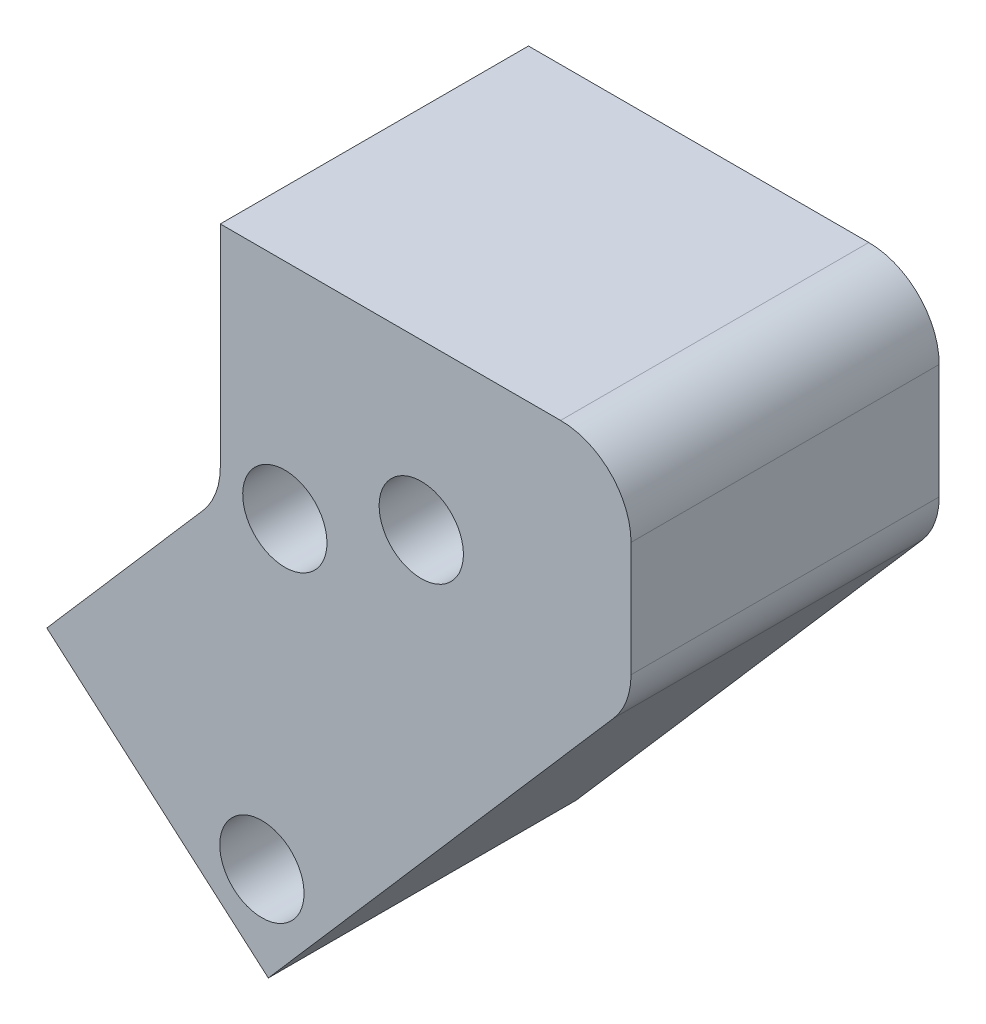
ISO-10303-21;
HEADER;
FILE_DESCRIPTION(('STEP AP214'),'2;1');
FILE_NAME('part.step','',(''),(''),'','','');
FILE_SCHEMA(('AUTOMOTIVE_DESIGN { 1 0 10303 214 1 1 1 1 }'));
ENDSEC;
DATA;
#1=APPLICATION_CONTEXT('core data for automotive mechanical design processes');
#2=APPLICATION_PROTOCOL_DEFINITION('international standard','automotive_design',2000,#1);
#3=PRODUCT_CONTEXT('',#1,'mechanical');
#4=PRODUCT('Part','Part','',(#3));
#5=PRODUCT_RELATED_PRODUCT_CATEGORY('part','',(#4));
#6=PRODUCT_DEFINITION_FORMATION('','',#4);
#7=PRODUCT_DEFINITION_CONTEXT('part definition',#1,'design');
#8=PRODUCT_DEFINITION('design','',#6,#7);
#9=PRODUCT_DEFINITION_SHAPE('','',#8);
#10=(LENGTH_UNIT() NAMED_UNIT(*) SI_UNIT(.MILLI.,.METRE.));
#11=(NAMED_UNIT(*) PLANE_ANGLE_UNIT() SI_UNIT($,.RADIAN.));
#12=(NAMED_UNIT(*) SI_UNIT($,.STERADIAN.) SOLID_ANGLE_UNIT());
#13=UNCERTAINTY_MEASURE_WITH_UNIT(LENGTH_MEASURE(1.E-05),#10,'distance_accuracy_value','');
#14=(GEOMETRIC_REPRESENTATION_CONTEXT(3) GLOBAL_UNCERTAINTY_ASSIGNED_CONTEXT((#13)) GLOBAL_UNIT_ASSIGNED_CONTEXT((#10,
#11,#12)) REPRESENTATION_CONTEXT('',''));
#15=CARTESIAN_POINT('',(0.,0.,0.));
#16=DIRECTION('',(0.,0.,1.));
#17=DIRECTION('',(1.,0.,0.));
#18=AXIS2_PLACEMENT_3D('',#15,#16,#17);
#19=CARTESIAN_POINT('',(-682.349668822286,-60.4557863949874,26.0096));
#20=DIRECTION('',(0.75503010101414,-0.655690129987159,0.));
#21=DIRECTION('',(0.655690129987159,0.75503010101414,0.));
#22=AXIS2_PLACEMENT_3D('',#19,#20,#21);
#23=PLANE('',#22);
#24=DIRECTION('',(0.,0.,-1.));
#25=VECTOR('',#24,1.);
#26=CARTESIAN_POINT('',(-682.349668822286,-60.4557863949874,26.0096));
#27=LINE('',#26,#25);
#28=CARTESIAN_POINT('',(-682.349668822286,-60.4557863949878,1.59986188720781));
#29=VERTEX_POINT('',#28);
#30=CARTESIAN_POINT('',(-682.349668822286,-60.4557863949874,-31.75));
#31=VERTEX_POINT('',#30);
#32=EDGE_CURVE('E55',#29,#31,#27,.T.);
#33=ORIENTED_EDGE('',*,*,#32,.F.);
#34=DIRECTION('',(0.655690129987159,0.75503010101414,3.73824128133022E-12));
#35=VECTOR('',#34,1.);
#36=CARTESIAN_POINT('',(-682.349668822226,-60.4557863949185,1.59986188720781));
#37=LINE('',#36,#35);
#38=CARTESIAN_POINT('',(-665.441670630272,-40.9861512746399,1.59986188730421));
#39=VERTEX_POINT('',#38);
#40=EDGE_CURVE('E122',#29,#39,#37,.T.);
#41=ORIENTED_EDGE('',*,*,#40,.T.);
#42=DIRECTION('',(0.,0.,-1.));
#43=VECTOR('',#42,1.);
#44=CARTESIAN_POINT('',(-665.441670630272,-40.9861512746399,26.0096));
#45=LINE('',#44,#43);
#46=CARTESIAN_POINT('',(-665.441670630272,-40.9861512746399,-31.75));
#47=VERTEX_POINT('',#46);
#48=EDGE_CURVE('E69',#39,#47,#45,.T.);
#49=ORIENTED_EDGE('',*,*,#48,.T.);
#50=DIRECTION('',(-0.655690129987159,-0.75503010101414,0.));
#51=VECTOR('',#50,1.);
#52=CARTESIAN_POINT('',(-682.349668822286,-60.4557863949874,-31.75));
#53=LINE('',#52,#51);
#54=EDGE_CURVE('E195',#47,#31,#53,.T.);
#55=ORIENTED_EDGE('',*,*,#54,.T.);
#56=EDGE_LOOP('',(#33,#41,#49,#55));
#57=FACE_BOUND('',#56,.T.);
#58=ADVANCED_FACE('F47',(#57),#23,.F.);
#59=CARTESIAN_POINT('',(-658.377463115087,-81.2739480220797,26.0096));
#60=DIRECTION('',(0.655690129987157,0.755030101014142,0.));
#61=DIRECTION('',(-0.755030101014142,0.655690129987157,0.));
#62=AXIS2_PLACEMENT_3D('',#59,#60,#61);
#63=PLANE('',#62);
#64=DIRECTION('',(0.755030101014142,-0.655690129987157,0.));
#65=VECTOR('',#64,1.);
#66=CARTESIAN_POINT('',(-658.377463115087,-81.2739480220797,-31.75));
#67=LINE('',#66,#65);
#68=CARTESIAN_POINT('',(-658.377463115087,-81.2739480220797,-31.75));
#69=VERTEX_POINT('',#68);
#70=EDGE_CURVE('E141',#31,#69,#67,.T.);
#71=ORIENTED_EDGE('',*,*,#70,.T.);
#72=DIRECTION('',(0.,0.,-1.));
#73=VECTOR('',#72,1.);
#74=CARTESIAN_POINT('',(-658.377463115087,-81.2739480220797,26.0096));
#75=LINE('',#74,#73);
#76=CARTESIAN_POINT('',(-658.377463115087,-81.2739480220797,1.59986188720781));
#77=VERTEX_POINT('',#76);
#78=EDGE_CURVE('E133',#77,#69,#75,.T.);
#79=ORIENTED_EDGE('',*,*,#78,.F.);
#80=DIRECTION('',(-0.75503010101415,0.655690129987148,0.));
#81=VECTOR('',#80,1.);
#82=CARTESIAN_POINT('',(-525.165075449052,-196.959465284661,1.59986188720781));
#83=LINE('',#82,#81);
#84=EDGE_CURVE('E117',#77,#29,#83,.T.);
#85=ORIENTED_EDGE('',*,*,#84,.T.);
#86=ORIENTED_EDGE('',*,*,#32,.T.);
#87=EDGE_LOOP('',(#71,#79,#85,#86));
#88=FACE_BOUND('',#87,.T.);
#89=ADVANCED_FACE('F139',(#88),#63,.F.);
#90=CARTESIAN_POINT('',(-658.377463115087,-81.2739480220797,26.0096));
#91=DIRECTION('',(-0.755030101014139,0.65569012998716,0.));
#92=DIRECTION('',(-0.65569012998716,-0.755030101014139,0.));
#93=AXIS2_PLACEMENT_3D('',#90,#91,#92);
#94=PLANE('',#93);
#95=DIRECTION('',(0.,0.,-1.));
#96=VECTOR('',#95,1.);
#97=CARTESIAN_POINT('',(-620.991670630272,-38.2240416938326,26.0096));
#98=LINE('',#97,#96);
#99=CARTESIAN_POINT('',(-620.991670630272,-38.2240416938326,1.59986188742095));
#100=VERTEX_POINT('',#99);
#101=CARTESIAN_POINT('',(-620.991670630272,-38.2240416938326,-31.75));
#102=VERTEX_POINT('',#101);
#103=EDGE_CURVE('E135',#100,#102,#98,.T.);
#104=ORIENTED_EDGE('',*,*,#103,.F.);
#105=DIRECTION('',(-0.65569012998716,-0.755030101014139,-3.73824128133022E-12));
#106=VECTOR('',#105,1.);
#107=CARTESIAN_POINT('',(-658.377463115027,-81.2739480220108,1.59986188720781));
#108=LINE('',#107,#106);
#109=EDGE_CURVE('E120',#100,#77,#108,.T.);
#110=ORIENTED_EDGE('',*,*,#109,.T.);
#111=ORIENTED_EDGE('',*,*,#78,.T.);
#112=DIRECTION('',(0.65569012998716,0.755030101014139,0.));
#113=VECTOR('',#112,1.);
#114=CARTESIAN_POINT('',(-658.377463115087,-81.2739480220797,-31.75));
#115=LINE('',#114,#113);
#116=EDGE_CURVE('E190',#69,#102,#115,.T.);
#117=ORIENTED_EDGE('',*,*,#116,.T.);
#118=EDGE_LOOP('',(#104,#110,#111,#117));
#119=FACE_BOUND('',#118,.T.);
#120=ADVANCED_FACE('F131',(#119),#94,.F.);
#121=CARTESIAN_POINT('',(-626.745,-33.2276829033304,26.0096));
#122=DIRECTION('',(0.,0.,-1.));
#123=DIRECTION('',(-1.,0.,0.));
#124=AXIS2_PLACEMENT_3D('',#121,#122,#123);
#125=CYLINDRICAL_SURFACE('',#124,7.61999999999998);
#126=DIRECTION('',(0.,0.,-1.));
#127=VECTOR('',#126,1.);
#128=CARTESIAN_POINT('',(-619.125,-33.2276829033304,26.0096));
#129=LINE('',#128,#127);
#130=CARTESIAN_POINT('',(-619.125,-33.2276829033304,1.59986188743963));
#131=VERTEX_POINT('',#130);
#132=CARTESIAN_POINT('',(-619.125,-33.2276829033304,-31.75));
#133=VERTEX_POINT('',#132);
#134=EDGE_CURVE('E148',#131,#133,#129,.T.);
#135=ORIENTED_EDGE('',*,*,#134,.F.);
#136=CARTESIAN_POINT('',(-626.745,-33.2276829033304,1.59986188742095));
#137=DIRECTION('',(2.45112791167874E-12,2.82248469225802E-12,-1.));
#138=DIRECTION('',(0.,1.,2.82248469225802E-12));
#139=AXIS2_PLACEMENT_3D('',#136,#137,#138);
#140=CIRCLE('',#139,7.61999999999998);
#141=EDGE_CURVE('E137',#131,#100,#140,.T.);
#142=ORIENTED_EDGE('',*,*,#141,.T.);
#143=ORIENTED_EDGE('',*,*,#103,.T.);
#144=CARTESIAN_POINT('',(-626.745,-33.2276829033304,-31.75));
#145=DIRECTION('',(0.,0.,1.));
#146=DIRECTION('',(-1.,0.,0.));
#147=AXIS2_PLACEMENT_3D('',#144,#145,#146);
#148=CIRCLE('',#147,7.61999999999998);
#149=EDGE_CURVE('E186',#102,#133,#148,.T.);
#150=ORIENTED_EDGE('',*,*,#149,.T.);
#151=EDGE_LOOP('',(#135,#142,#143,#150));
#152=FACE_BOUND('',#151,.T.);
#153=ADVANCED_FACE('F319',(#152),#125,.T.);
#154=CARTESIAN_POINT('',(-619.125,-20.8198728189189,26.0096));
#155=DIRECTION('',(-1.,0.,0.));
#156=DIRECTION('',(0.,0.,1.));
#157=AXIS2_PLACEMENT_3D('',#154,#155,#156);
#158=PLANE('',#157);
#159=DIRECTION('',(0.,0.,-1.));
#160=VECTOR('',#159,1.);
#161=CARTESIAN_POINT('',(-619.125,-20.8198728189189,26.0096));
#162=LINE('',#161,#160);
#163=CARTESIAN_POINT('',(-619.125,-20.8198728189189,1.59986188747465));
#164=VERTEX_POINT('',#163);
#165=CARTESIAN_POINT('',(-619.125,-20.8198728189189,-31.75));
#166=VERTEX_POINT('',#165);
#167=EDGE_CURVE('E153',#164,#166,#162,.T.);
#168=ORIENTED_EDGE('',*,*,#167,.F.);
#169=DIRECTION('',(0.,-1.,-2.82248469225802E-12));
#170=VECTOR('',#169,1.);
#171=CARTESIAN_POINT('',(-619.125,-20.81987281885,1.59986188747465));
#172=LINE('',#171,#170);
#173=EDGE_CURVE('E202',#164,#131,#172,.T.);
#174=ORIENTED_EDGE('',*,*,#173,.T.);
#175=ORIENTED_EDGE('',*,*,#134,.T.);
#176=DIRECTION('',(0.,1.,0.));
#177=VECTOR('',#176,1.);
#178=CARTESIAN_POINT('',(-619.125,-20.8198728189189,-31.75));
#179=LINE('',#178,#177);
#180=EDGE_CURVE('E182',#133,#166,#179,.T.);
#181=ORIENTED_EDGE('',*,*,#180,.T.);
#182=EDGE_LOOP('',(#168,#174,#175,#181));
#183=FACE_BOUND('',#182,.T.);
#184=ADVANCED_FACE('F322',(#183),#158,.F.);
#185=CARTESIAN_POINT('',(-626.745,-20.8198728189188,26.0096));
#186=DIRECTION('',(0.,0.,-1.));
#187=DIRECTION('',(-1.,0.,0.));
#188=AXIS2_PLACEMENT_3D('',#185,#186,#187);
#189=CYLINDRICAL_SURFACE('',#188,7.61999999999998);
#190=DIRECTION('',(0.,0.,-1.));
#191=VECTOR('',#190,1.);
#192=CARTESIAN_POINT('',(-626.745,-13.1998728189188,26.0096));
#193=LINE('',#192,#191);
#194=CARTESIAN_POINT('',(-626.745,-13.1998728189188,1.59986188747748));
#195=VERTEX_POINT('',#194);
#196=CARTESIAN_POINT('',(-626.745,-13.1998728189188,-31.75));
#197=VERTEX_POINT('',#196);
#198=EDGE_CURVE('E156',#195,#197,#193,.T.);
#199=ORIENTED_EDGE('',*,*,#198,.F.);
#200=CARTESIAN_POINT('',(-626.745,-20.8198728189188,1.59986188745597));
#201=DIRECTION('',(2.45112791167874E-12,2.82248469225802E-12,-1.));
#202=DIRECTION('',(0.,1.,2.82248469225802E-12));
#203=AXIS2_PLACEMENT_3D('',#200,#201,#202);
#204=CIRCLE('',#203,7.61999999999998);
#205=EDGE_CURVE('E206',#195,#164,#204,.T.);
#206=ORIENTED_EDGE('',*,*,#205,.T.);
#207=ORIENTED_EDGE('',*,*,#167,.T.);
#208=CARTESIAN_POINT('',(-626.745,-20.8198728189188,-31.75));
#209=DIRECTION('',(0.,0.,1.));
#210=DIRECTION('',(1.,0.,0.));
#211=AXIS2_PLACEMENT_3D('',#208,#209,#210);
#212=CIRCLE('',#211,7.61999999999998);
#213=EDGE_CURVE('E178',#166,#197,#212,.T.);
#214=ORIENTED_EDGE('',*,*,#213,.T.);
#215=EDGE_LOOP('',(#199,#206,#207,#214));
#216=FACE_BOUND('',#215,.T.);
#217=ADVANCED_FACE('F325',(#216),#189,.T.);
#218=CARTESIAN_POINT('',(-663.575,-13.1998728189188,26.0096));
#219=DIRECTION('',(0.,-1.,0.));
#220=DIRECTION('',(1.,0.,0.));
#221=AXIS2_PLACEMENT_3D('',#218,#219,#220);
#222=PLANE('',#221);
#223=DIRECTION('',(0.,0.,-1.));
#224=VECTOR('',#223,1.);
#225=CARTESIAN_POINT('',(-663.575,-13.1998728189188,26.0096));
#226=LINE('',#225,#224);
#227=CARTESIAN_POINT('',(-663.575,-13.1998728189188,1.59986188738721));
#228=VERTEX_POINT('',#227);
#229=CARTESIAN_POINT('',(-663.575,-13.1998728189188,-31.75));
#230=VERTEX_POINT('',#229);
#231=EDGE_CURVE('E159',#228,#230,#226,.T.);
#232=ORIENTED_EDGE('',*,*,#231,.F.);
#233=DIRECTION('',(1.,0.,2.45112791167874E-12));
#234=VECTOR('',#233,1.);
#235=CARTESIAN_POINT('',(-663.57499999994,-13.1998728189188,1.59986188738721));
#236=LINE('',#235,#234);
#237=EDGE_CURVE('E210',#228,#195,#236,.T.);
#238=ORIENTED_EDGE('',*,*,#237,.T.);
#239=ORIENTED_EDGE('',*,*,#198,.T.);
#240=DIRECTION('',(-1.,0.,0.));
#241=VECTOR('',#240,1.);
#242=CARTESIAN_POINT('',(-663.575,-13.1998728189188,-31.75));
#243=LINE('',#242,#241);
#244=EDGE_CURVE('E174',#197,#230,#243,.T.);
#245=ORIENTED_EDGE('',*,*,#244,.T.);
#246=EDGE_LOOP('',(#232,#238,#239,#245));
#247=FACE_BOUND('',#246,.T.);
#248=ADVANCED_FACE('F329',(#247),#222,.F.);
#249=CARTESIAN_POINT('',(-663.575,-35.989792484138,26.0096));
#250=DIRECTION('',(1.,0.,0.));
#251=DIRECTION('',(0.,1.,0.));
#252=AXIS2_PLACEMENT_3D('',#249,#250,#251);
#253=PLANE('',#252);
#254=DIRECTION('',(0.,0.,-1.));
#255=VECTOR('',#254,1.);
#256=CARTESIAN_POINT('',(-663.575,-35.989792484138,26.0096));
#257=LINE('',#256,#255);
#258=CARTESIAN_POINT('',(-663.575,-35.989792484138,1.59986188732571));
#259=VERTEX_POINT('',#258);
#260=CARTESIAN_POINT('',(-663.575,-35.989792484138,-31.75));
#261=VERTEX_POINT('',#260);
#262=EDGE_CURVE('E162',#259,#261,#257,.T.);
#263=ORIENTED_EDGE('',*,*,#262,.F.);
#264=DIRECTION('',(0.,1.,2.82248469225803E-12));
#265=VECTOR('',#264,1.);
#266=CARTESIAN_POINT('',(-663.575,-35.9897924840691,1.59986188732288));
#267=LINE('',#266,#265);
#268=EDGE_CURVE('E62',#259,#228,#267,.T.);
#269=ORIENTED_EDGE('',*,*,#268,.T.);
#270=ORIENTED_EDGE('',*,*,#231,.T.);
#271=DIRECTION('',(0.,-1.,0.));
#272=VECTOR('',#271,1.);
#273=CARTESIAN_POINT('',(-663.575,-35.989792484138,-31.75));
#274=LINE('',#273,#272);
#275=EDGE_CURVE('E170',#230,#261,#274,.T.);
#276=ORIENTED_EDGE('',*,*,#275,.T.);
#277=EDGE_LOOP('',(#263,#269,#270,#276));
#278=FACE_BOUND('',#277,.T.);
#279=ADVANCED_FACE('F333',(#278),#253,.F.);
#280=CARTESIAN_POINT('',(-671.195,-35.989792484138,26.0096));
#281=DIRECTION('',(0.,0.,-1.));
#282=DIRECTION('',(-1.,0.,0.));
#283=AXIS2_PLACEMENT_3D('',#280,#281,#282);
#284=CYLINDRICAL_SURFACE('',#283,7.61999999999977);
#285=ORIENTED_EDGE('',*,*,#48,.F.);
#286=CARTESIAN_POINT('',(-671.195,-35.989792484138,1.59986188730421));
#287=DIRECTION('',(2.45112791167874E-12,2.82248469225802E-12,-1.));
#288=DIRECTION('',(0.,1.,2.82248469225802E-12));
#289=AXIS2_PLACEMENT_3D('',#286,#287,#288);
#290=CIRCLE('',#289,7.61999999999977);
#291=EDGE_CURVE('E11',#39,#259,#290,.F.);
#292=ORIENTED_EDGE('',*,*,#291,.T.);
#293=ORIENTED_EDGE('',*,*,#262,.T.);
#294=CARTESIAN_POINT('',(-671.195,-35.989792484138,-31.75));
#295=DIRECTION('',(0.,0.,-1.));
#296=DIRECTION('',(-1.,0.,0.));
#297=AXIS2_PLACEMENT_3D('',#294,#295,#296);
#298=CIRCLE('',#297,7.61999999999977);
#299=EDGE_CURVE('E167',#261,#47,#298,.T.);
#300=ORIENTED_EDGE('',*,*,#299,.T.);
#301=EDGE_LOOP('',(#285,#292,#293,#300));
#302=FACE_BOUND('',#301,.T.);
#303=ADVANCED_FACE('F335',(#302),#284,.F.);
#304=CARTESIAN_POINT('',(-671.195,-35.989792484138,-31.75));
#305=DIRECTION('',(0.,0.,-1.));
#306=DIRECTION('',(-1.,0.,0.));
#307=AXIS2_PLACEMENT_3D('',#304,#305,#306);
#308=PLANE('',#307);
#309=CARTESIAN_POINT('',(-659.071352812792,-71.4200672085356,-31.7500000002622));
#310=DIRECTION('',(0.,-2.82248469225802E-12,1.));
#311=DIRECTION('',(0.,-1.,-2.82248469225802E-12));
#312=AXIS2_PLACEMENT_3D('',#309,#310,#311);
#313=CIRCLE('',#312,2.80669999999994);
#314=CARTESIAN_POINT('',(-659.071352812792,-74.2267672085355,-31.7500000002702));
#315=VERTEX_POINT('',#314);
#316=EDGE_CURVE('E259',#315,#315,#313,.T.);
#317=ORIENTED_EDGE('',*,*,#316,.T.);
#318=EDGE_LOOP('',(#317));
#319=FACE_BOUND('',#318,.T.);
#320=CARTESIAN_POINT('',(-656.590000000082,-37.3298728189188,-31.7500000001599));
#321=DIRECTION('',(0.,-2.82248469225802E-12,1.));
#322=DIRECTION('',(0.,-1.,-2.82248469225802E-12));
#323=AXIS2_PLACEMENT_3D('',#320,#321,#322);
#324=CIRCLE('',#323,2.80669999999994);
#325=CARTESIAN_POINT('',(-656.590000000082,-40.1365728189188,-31.7500000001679));
#326=VERTEX_POINT('',#325);
#327=EDGE_CURVE('E243',#326,#326,#324,.T.);
#328=ORIENTED_EDGE('',*,*,#327,.T.);
#329=EDGE_LOOP('',(#328));
#330=FACE_BOUND('',#329,.T.);
#331=CARTESIAN_POINT('',(-641.825795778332,-31.0085922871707,-31.7500000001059));
#332=DIRECTION('',(0.,-2.82248469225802E-12,1.));
#333=DIRECTION('',(0.,-1.,-2.82248469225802E-12));
#334=AXIS2_PLACEMENT_3D('',#331,#332,#333);
#335=CIRCLE('',#334,2.80669999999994);
#336=CARTESIAN_POINT('',(-641.825795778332,-33.8152922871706,-31.7500000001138));
#337=VERTEX_POINT('',#336);
#338=EDGE_CURVE('E227',#337,#337,#335,.T.);
#339=ORIENTED_EDGE('',*,*,#338,.T.);
#340=EDGE_LOOP('',(#339));
#341=FACE_BOUND('',#340,.T.);
#342=ORIENTED_EDGE('',*,*,#54,.F.);
#343=ORIENTED_EDGE('',*,*,#299,.F.);
#344=ORIENTED_EDGE('',*,*,#275,.F.);
#345=ORIENTED_EDGE('',*,*,#244,.F.);
#346=ORIENTED_EDGE('',*,*,#213,.F.);
#347=ORIENTED_EDGE('',*,*,#180,.F.);
#348=ORIENTED_EDGE('',*,*,#149,.F.);
#349=ORIENTED_EDGE('',*,*,#116,.F.);
#350=ORIENTED_EDGE('',*,*,#70,.F.);
#351=EDGE_LOOP('',(#342,#343,#344,#345,#346,#347,#348,#349,#350));
#352=FACE_BOUND('',#351,.T.);
#353=ADVANCED_FACE('F265',(#319,#330,#341,#352),#308,.T.);
#354=CARTESIAN_POINT('',(-449.386967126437,-109.700636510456,1.59986188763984));
#355=DIRECTION('',(2.45112791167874E-12,2.82248469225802E-12,-1.));
#356=DIRECTION('',(0.,1.,2.82248469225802E-12));
#357=AXIS2_PLACEMENT_3D('',#354,#355,#356);
#358=PLANE('',#357);
#359=CARTESIAN_POINT('',(-659.071352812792,-71.4200672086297,1.59986188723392));
#360=DIRECTION('',(0.,-2.82248469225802E-12,1.));
#361=DIRECTION('',(0.,-1.,-2.82248469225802E-12));
#362=AXIS2_PLACEMENT_3D('',#359,#360,#361);
#363=CIRCLE('',#362,4.55930000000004);
#364=CARTESIAN_POINT('',(-659.071352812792,-75.9793672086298,1.59986188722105));
#365=VERTEX_POINT('',#364);
#366=EDGE_CURVE('E247',#365,#365,#363,.T.);
#367=ORIENTED_EDGE('',*,*,#366,.F.);
#368=EDGE_LOOP('',(#367));
#369=FACE_BOUND('',#368,.T.);
#370=CARTESIAN_POINT('',(-656.590000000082,-37.3298728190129,1.59986188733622));
#371=DIRECTION('',(0.,-2.82248469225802E-12,1.));
#372=DIRECTION('',(0.,-1.,-2.82248469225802E-12));
#373=AXIS2_PLACEMENT_3D('',#370,#371,#372);
#374=CIRCLE('',#373,4.55930000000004);
#375=CARTESIAN_POINT('',(-656.590000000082,-41.889172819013,1.59986188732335));
#376=VERTEX_POINT('',#375);
#377=EDGE_CURVE('E231',#376,#376,#374,.T.);
#378=ORIENTED_EDGE('',*,*,#377,.F.);
#379=EDGE_LOOP('',(#378));
#380=FACE_BOUND('',#379,.T.);
#381=CARTESIAN_POINT('',(-641.825795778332,-31.0085922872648,1.59986188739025));
#382=DIRECTION('',(0.,-2.82248469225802E-12,1.));
#383=DIRECTION('',(0.,-1.,-2.82248469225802E-12));
#384=AXIS2_PLACEMENT_3D('',#381,#382,#383);
#385=CIRCLE('',#384,4.55930000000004);
#386=CARTESIAN_POINT('',(-641.825795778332,-35.5678922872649,1.59986188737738));
#387=VERTEX_POINT('',#386);
#388=EDGE_CURVE('E127',#387,#387,#385,.T.);
#389=ORIENTED_EDGE('',*,*,#388,.F.);
#390=EDGE_LOOP('',(#389));
#391=FACE_BOUND('',#390,.T.);
#392=ORIENTED_EDGE('',*,*,#40,.F.);
#393=ORIENTED_EDGE('',*,*,#84,.F.);
#394=ORIENTED_EDGE('',*,*,#109,.F.);
#395=ORIENTED_EDGE('',*,*,#141,.F.);
#396=ORIENTED_EDGE('',*,*,#173,.F.);
#397=ORIENTED_EDGE('',*,*,#205,.F.);
#398=ORIENTED_EDGE('',*,*,#237,.F.);
#399=ORIENTED_EDGE('',*,*,#268,.F.);
#400=ORIENTED_EDGE('',*,*,#291,.F.);
#401=EDGE_LOOP('',(#392,#393,#394,#395,#396,#397,#398,#399,#400));
#402=FACE_BOUND('',#401,.T.);
#403=ADVANCED_FACE('F119',(#369,#380,#391,#402),#358,.F.);
#404=CARTESIAN_POINT('',(-641.825795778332,-31.0085922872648,1.59986188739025));
#405=DIRECTION('',(0.,-2.82248469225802E-12,1.));
#406=DIRECTION('',(0.,-1.,-2.82248469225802E-12));
#407=AXIS2_PLACEMENT_3D('',#404,#405,#406);
#408=CYLINDRICAL_SURFACE('',#407,4.55930000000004);
#409=CARTESIAN_POINT('',(-641.825795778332,-31.0085922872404,-7.03613811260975));
#410=DIRECTION('',(0.,-2.82248469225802E-12,1.));
#411=DIRECTION('',(0.,-1.,-2.82248469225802E-12));
#412=AXIS2_PLACEMENT_3D('',#409,#410,#411);
#413=CIRCLE('',#412,4.55930000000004);
#414=CARTESIAN_POINT('',(-641.825795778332,-35.5678922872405,-7.03613811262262));
#415=VERTEX_POINT('',#414);
#416=EDGE_CURVE('E219',#415,#415,#413,.T.);
#417=ORIENTED_EDGE('',*,*,#416,.F.);
#418=EDGE_LOOP('',(#417));
#419=FACE_BOUND('',#418,.T.);
#420=ORIENTED_EDGE('',*,*,#388,.T.);
#421=EDGE_LOOP('',(#420));
#422=FACE_BOUND('',#421,.T.);
#423=ADVANCED_FACE('F289',(#419,#422),#408,.F.);
#424=CARTESIAN_POINT('',(-639.019095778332,-31.0085922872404,-7.03613811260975));
#425=DIRECTION('',(0.,2.82248469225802E-12,-1.));
#426=DIRECTION('',(0.,1.,2.82248469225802E-12));
#427=AXIS2_PLACEMENT_3D('',#424,#425,#426);
#428=PLANE('',#427);
#429=CARTESIAN_POINT('',(-641.825795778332,-31.0085922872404,-7.03613811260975));
#430=DIRECTION('',(0.,-2.82248469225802E-12,1.));
#431=DIRECTION('',(0.,-1.,-2.82248469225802E-12));
#432=AXIS2_PLACEMENT_3D('',#429,#430,#431);
#433=CIRCLE('',#432,2.80670000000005);
#434=CARTESIAN_POINT('',(-641.825795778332,-33.8152922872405,-7.03613811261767));
#435=VERTEX_POINT('',#434);
#436=EDGE_CURVE('E223',#435,#435,#433,.T.);
#437=ORIENTED_EDGE('',*,*,#436,.F.);
#438=EDGE_LOOP('',(#437));
#439=FACE_BOUND('',#438,.T.);
#440=ORIENTED_EDGE('',*,*,#416,.T.);
#441=EDGE_LOOP('',(#440));
#442=FACE_BOUND('',#441,.T.);
#443=ADVANCED_FACE('F296',(#439,#442),#428,.F.);
#444=CARTESIAN_POINT('',(-641.825795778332,-31.0085922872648,1.59986188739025));
#445=DIRECTION('',(0.,-2.82248469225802E-12,1.));
#446=DIRECTION('',(0.,-1.,-2.82248469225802E-12));
#447=AXIS2_PLACEMENT_3D('',#444,#445,#446);
#448=CYLINDRICAL_SURFACE('',#447,2.8067);
#449=ORIENTED_EDGE('',*,*,#338,.F.);
#450=EDGE_LOOP('',(#449));
#451=FACE_BOUND('',#450,.T.);
#452=ORIENTED_EDGE('',*,*,#436,.T.);
#453=EDGE_LOOP('',(#452));
#454=FACE_BOUND('',#453,.T.);
#455=ADVANCED_FACE('F303',(#451,#454),#448,.F.);
#456=CARTESIAN_POINT('',(-656.590000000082,-37.3298728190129,1.59986188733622));
#457=DIRECTION('',(0.,-2.82248469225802E-12,1.));
#458=DIRECTION('',(0.,-1.,-2.82248469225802E-12));
#459=AXIS2_PLACEMENT_3D('',#456,#457,#458);
#460=CYLINDRICAL_SURFACE('',#459,4.55930000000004);
#461=CARTESIAN_POINT('',(-656.590000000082,-37.3298728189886,-7.03613811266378));
#462=DIRECTION('',(0.,-2.82248469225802E-12,1.));
#463=DIRECTION('',(0.,-1.,-2.82248469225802E-12));
#464=AXIS2_PLACEMENT_3D('',#461,#462,#463);
#465=CIRCLE('',#464,4.55930000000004);
#466=CARTESIAN_POINT('',(-656.590000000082,-41.8891728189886,-7.03613811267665));
#467=VERTEX_POINT('',#466);
#468=EDGE_CURVE('E235',#467,#467,#465,.T.);
#469=ORIENTED_EDGE('',*,*,#468,.F.);
#470=EDGE_LOOP('',(#469));
#471=FACE_BOUND('',#470,.T.);
#472=ORIENTED_EDGE('',*,*,#377,.T.);
#473=EDGE_LOOP('',(#472));
#474=FACE_BOUND('',#473,.T.);
#475=ADVANCED_FACE('F422',(#471,#474),#460,.F.);
#476=CARTESIAN_POINT('',(-653.783300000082,-37.3298728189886,-7.03613811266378));
#477=DIRECTION('',(0.,2.82248469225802E-12,-1.));
#478=DIRECTION('',(0.,1.,2.82248469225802E-12));
#479=AXIS2_PLACEMENT_3D('',#476,#477,#478);
#480=PLANE('',#479);
#481=CARTESIAN_POINT('',(-656.590000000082,-37.3298728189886,-7.03613811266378));
#482=DIRECTION('',(0.,-2.82248469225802E-12,1.));
#483=DIRECTION('',(0.,-1.,-2.82248469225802E-12));
#484=AXIS2_PLACEMENT_3D('',#481,#482,#483);
#485=CIRCLE('',#484,2.80670000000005);
#486=CARTESIAN_POINT('',(-656.590000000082,-40.1365728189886,-7.0361381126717));
#487=VERTEX_POINT('',#486);
#488=EDGE_CURVE('E239',#487,#487,#485,.T.);
#489=ORIENTED_EDGE('',*,*,#488,.F.);
#490=EDGE_LOOP('',(#489));
#491=FACE_BOUND('',#490,.T.);
#492=ORIENTED_EDGE('',*,*,#468,.T.);
#493=EDGE_LOOP('',(#492));
#494=FACE_BOUND('',#493,.T.);
#495=ADVANCED_FACE('F433',(#491,#494),#480,.F.);
#496=CARTESIAN_POINT('',(-656.590000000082,-37.3298728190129,1.59986188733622));
#497=DIRECTION('',(0.,-2.82248469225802E-12,1.));
#498=DIRECTION('',(0.,-1.,-2.82248469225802E-12));
#499=AXIS2_PLACEMENT_3D('',#496,#497,#498);
#500=CYLINDRICAL_SURFACE('',#499,2.8067);
#501=ORIENTED_EDGE('',*,*,#327,.F.);
#502=EDGE_LOOP('',(#501));
#503=FACE_BOUND('',#502,.T.);
#504=ORIENTED_EDGE('',*,*,#488,.T.);
#505=EDGE_LOOP('',(#504));
#506=FACE_BOUND('',#505,.T.);
#507=ADVANCED_FACE('F283',(#503,#506),#500,.F.);
#508=CARTESIAN_POINT('',(-659.071352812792,-71.4200672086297,1.59986188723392));
#509=DIRECTION('',(0.,-2.82248469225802E-12,1.));
#510=DIRECTION('',(0.,-1.,-2.82248469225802E-12));
#511=AXIS2_PLACEMENT_3D('',#508,#509,#510);
#512=CYLINDRICAL_SURFACE('',#511,4.55930000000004);
#513=CARTESIAN_POINT('',(-659.071352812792,-71.4200672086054,-7.03613811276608));
#514=DIRECTION('',(0.,-2.82248469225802E-12,1.));
#515=DIRECTION('',(0.,-1.,-2.82248469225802E-12));
#516=AXIS2_PLACEMENT_3D('',#513,#514,#515);
#517=CIRCLE('',#516,4.55930000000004);
#518=CARTESIAN_POINT('',(-659.071352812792,-75.9793672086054,-7.03613811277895));
#519=VERTEX_POINT('',#518);
#520=EDGE_CURVE('E251',#519,#519,#517,.T.);
#521=ORIENTED_EDGE('',*,*,#520,.F.);
#522=EDGE_LOOP('',(#521));
#523=FACE_BOUND('',#522,.T.);
#524=ORIENTED_EDGE('',*,*,#366,.T.);
#525=EDGE_LOOP('',(#524));
#526=FACE_BOUND('',#525,.T.);
#527=ADVANCED_FACE('F277',(#523,#526),#512,.F.);
#528=CARTESIAN_POINT('',(-656.264652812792,-71.4200672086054,-7.03613811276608));
#529=DIRECTION('',(0.,2.82248469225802E-12,-1.));
#530=DIRECTION('',(0.,1.,2.82248469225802E-12));
#531=AXIS2_PLACEMENT_3D('',#528,#529,#530);
#532=PLANE('',#531);
#533=CARTESIAN_POINT('',(-659.071352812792,-71.4200672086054,-7.03613811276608));
#534=DIRECTION('',(0.,-2.82248469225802E-12,1.));
#535=DIRECTION('',(0.,-1.,-2.82248469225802E-12));
#536=AXIS2_PLACEMENT_3D('',#533,#534,#535);
#537=CIRCLE('',#536,2.80670000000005);
#538=CARTESIAN_POINT('',(-659.071352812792,-74.2267672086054,-7.036138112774));
#539=VERTEX_POINT('',#538);
#540=EDGE_CURVE('E255',#539,#539,#537,.T.);
#541=ORIENTED_EDGE('',*,*,#540,.F.);
#542=EDGE_LOOP('',(#541));
#543=FACE_BOUND('',#542,.T.);
#544=ORIENTED_EDGE('',*,*,#520,.T.);
#545=EDGE_LOOP('',(#544));
#546=FACE_BOUND('',#545,.T.);
#547=ADVANCED_FACE('F271',(#543,#546),#532,.F.);
#548=CARTESIAN_POINT('',(-659.071352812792,-71.4200672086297,1.59986188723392));
#549=DIRECTION('',(0.,-2.82248469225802E-12,1.));
#550=DIRECTION('',(0.,-1.,-2.82248469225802E-12));
#551=AXIS2_PLACEMENT_3D('',#548,#549,#550);
#552=CYLINDRICAL_SURFACE('',#551,2.8067);
#553=ORIENTED_EDGE('',*,*,#316,.F.);
#554=EDGE_LOOP('',(#553));
#555=FACE_BOUND('',#554,.T.);
#556=ORIENTED_EDGE('',*,*,#540,.T.);
#557=EDGE_LOOP('',(#556));
#558=FACE_BOUND('',#557,.T.);
#559=ADVANCED_FACE('F268',(#555,#558),#552,.F.);
#560=CLOSED_SHELL('',(#58,#89,#120,#153,#184,#217,#248,#279,#303,#353,#403,#423,#443,#455,#475,
#495,#507,#527,#547,#559));
#561=MANIFOLD_SOLID_BREP('B2',#560);
#562=ADVANCED_BREP_SHAPE_REPRESENTATION('',(#18,#561),#14);
#563=SHAPE_DEFINITION_REPRESENTATION(#9,#562);
ENDSEC;
END-ISO-10303-21;
